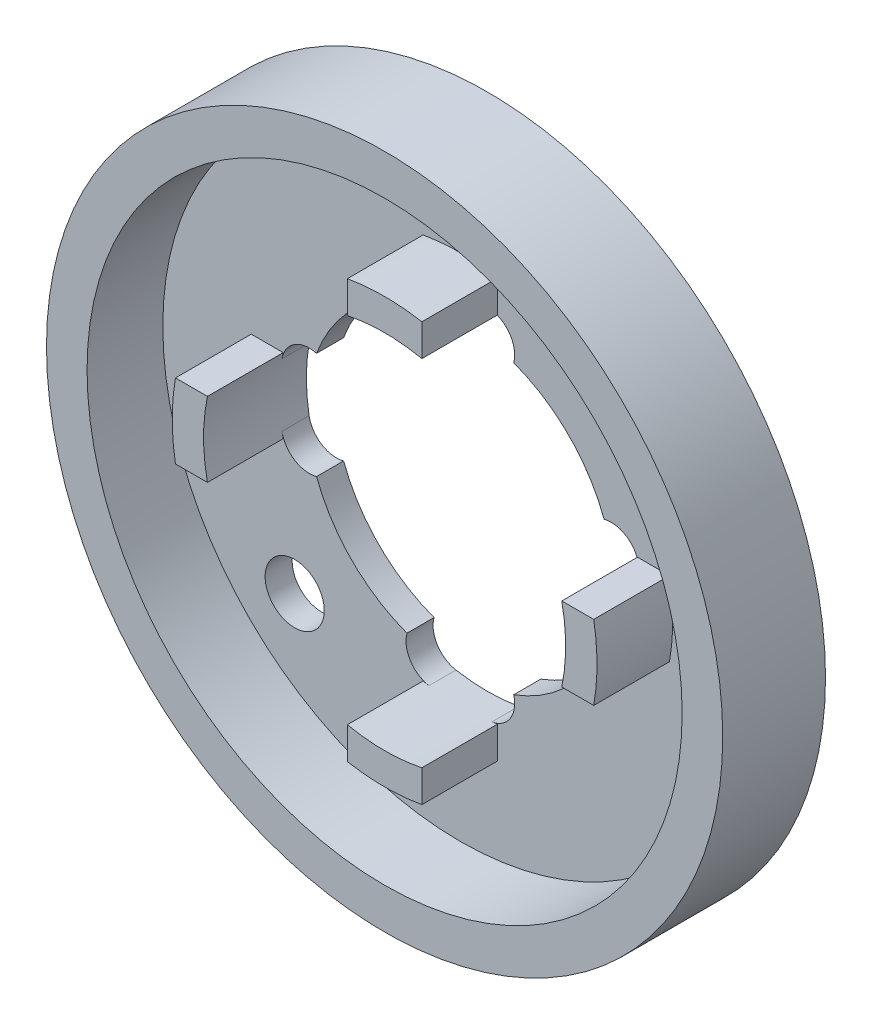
ISO-10303-21;
HEADER;
FILE_DESCRIPTION(('STEP AP214'),'2;1');
FILE_NAME('part.step','',(''),(''),'','','');
FILE_SCHEMA(('AUTOMOTIVE_DESIGN { 1 0 10303 214 1 1 1 1 }'));
ENDSEC;
DATA;
#1=APPLICATION_CONTEXT('core data for automotive mechanical design processes');
#2=APPLICATION_PROTOCOL_DEFINITION('international standard','automotive_design',2000,#1);
#3=PRODUCT_CONTEXT('',#1,'mechanical');
#4=PRODUCT('Part','Part','',(#3));
#5=PRODUCT_RELATED_PRODUCT_CATEGORY('part','',(#4));
#6=PRODUCT_DEFINITION_FORMATION('','',#4);
#7=PRODUCT_DEFINITION_CONTEXT('part definition',#1,'design');
#8=PRODUCT_DEFINITION('design','',#6,#7);
#9=PRODUCT_DEFINITION_SHAPE('','',#8);
#10=(LENGTH_UNIT() NAMED_UNIT(*) SI_UNIT(.MILLI.,.METRE.));
#11=(NAMED_UNIT(*) PLANE_ANGLE_UNIT() SI_UNIT($,.RADIAN.));
#12=(NAMED_UNIT(*) SI_UNIT($,.STERADIAN.) SOLID_ANGLE_UNIT());
#13=UNCERTAINTY_MEASURE_WITH_UNIT(LENGTH_MEASURE(1.E-05),#10,'distance_accuracy_value','');
#14=(GEOMETRIC_REPRESENTATION_CONTEXT(3) GLOBAL_UNCERTAINTY_ASSIGNED_CONTEXT((#13)) GLOBAL_UNIT_ASSIGNED_CONTEXT((#10,
#11,#12)) REPRESENTATION_CONTEXT('',''));
#15=CARTESIAN_POINT('',(0.,0.,0.));
#16=DIRECTION('',(0.,0.,1.));
#17=DIRECTION('',(1.,0.,0.));
#18=AXIS2_PLACEMENT_3D('',#15,#16,#17);
#19=CARTESIAN_POINT('',(0.,0.,0.));
#20=DIRECTION('',(0.,0.,1.));
#21=DIRECTION('',(1.,0.,0.));
#22=AXIS2_PLACEMENT_3D('',#19,#20,#21);
#23=PLANE('',#22);
#24=CARTESIAN_POINT('',(-7.77817459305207,-7.77817459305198,0.));
#25=DIRECTION('',(0.,0.,-1.));
#26=DIRECTION('',(-1.,0.,0.));
#27=AXIS2_PLACEMENT_3D('',#24,#25,#26);
#28=CIRCLE('',#27,1.38912599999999);
#29=CARTESIAN_POINT('',(-9.16730059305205,-7.77817459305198,0.));
#30=VERTEX_POINT('',#29);
#31=EDGE_CURVE('E528',#30,#30,#28,.T.);
#32=ORIENTED_EDGE('',*,*,#31,.F.);
#33=EDGE_LOOP('',(#32));
#34=FACE_BOUND('',#33,.T.);
#35=CARTESIAN_POINT('',(0.,0.,0.));
#36=DIRECTION('',(0.,0.,1.));
#37=DIRECTION('',(1.,0.,0.));
#38=AXIS2_PLACEMENT_3D('',#35,#36,#37);
#39=CIRCLE('',#38,15.875);
#40=CARTESIAN_POINT('',(15.875,0.,0.));
#41=VERTEX_POINT('',#40);
#42=EDGE_CURVE('E44',#41,#41,#39,.T.);
#43=ORIENTED_EDGE('',*,*,#42,.F.);
#44=EDGE_LOOP('',(#43));
#45=FACE_BOUND('',#44,.T.);
#46=CARTESIAN_POINT('',(0.,0.,0.));
#47=DIRECTION('',(0.,0.,1.));
#48=DIRECTION('',(1.,0.,0.));
#49=AXIS2_PLACEMENT_3D('',#46,#47,#48);
#50=CIRCLE('',#49,7.2);
#51=CARTESIAN_POINT('',(2.50490967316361,6.75021685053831,0.));
#52=VERTEX_POINT('',#51);
#53=CARTESIAN_POINT('',(6.75021685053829,2.50490967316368,0.));
#54=VERTEX_POINT('',#53);
#55=EDGE_CURVE('E508',#52,#54,#50,.F.);
#56=ORIENTED_EDGE('',*,*,#55,.F.);
#57=CARTESIAN_POINT('',(1.2502668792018,7.09061582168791,0.));
#58=DIRECTION('',(0.,0.,1.));
#59=DIRECTION('',(1.,0.,0.));
#60=AXIS2_PLACEMENT_3D('',#57,#58,#59);
#61=CIRCLE('',#60,1.3);
#62=CARTESIAN_POINT('',(1.47600951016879,8.37086590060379,0.));
#63=VERTEX_POINT('',#62);
#64=EDGE_CURVE('E534',#63,#52,#61,.F.);
#65=ORIENTED_EDGE('',*,*,#64,.F.);
#66=CARTESIAN_POINT('',(0.,0.,0.));
#67=DIRECTION('',(0.,0.,1.));
#68=DIRECTION('',(1.,0.,0.));
#69=AXIS2_PLACEMENT_3D('',#66,#67,#68);
#70=CIRCLE('',#69,8.5);
#71=CARTESIAN_POINT('',(-1.47600951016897,8.37086590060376,0.));
#72=VERTEX_POINT('',#71);
#73=EDGE_CURVE('E538',#72,#63,#70,.F.);
#74=ORIENTED_EDGE('',*,*,#73,.F.);
#75=CARTESIAN_POINT('',(-1.25026687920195,7.09061582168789,0.));
#76=DIRECTION('',(0.,0.,1.));
#77=DIRECTION('',(1.,0.,0.));
#78=AXIS2_PLACEMENT_3D('',#75,#76,#77);
#79=CIRCLE('',#78,1.3);
#80=CARTESIAN_POINT('',(-2.50490967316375,6.75021685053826,0.));
#81=VERTEX_POINT('',#80);
#82=EDGE_CURVE('E532',#81,#72,#79,.F.);
#83=ORIENTED_EDGE('',*,*,#82,.F.);
#84=CARTESIAN_POINT('',(-6.75021685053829,2.50490967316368,0.));
#85=VERTEX_POINT('',#84);
#86=EDGE_CURVE('E264',#85,#81,#50,.F.);
#87=ORIENTED_EDGE('',*,*,#86,.F.);
#88=CARTESIAN_POINT('',(-7.0906158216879,1.25026687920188,0.));
#89=DIRECTION('',(0.,0.,1.));
#90=DIRECTION('',(1.,0.,0.));
#91=AXIS2_PLACEMENT_3D('',#88,#89,#90);
#92=CIRCLE('',#91,1.3);
#93=CARTESIAN_POINT('',(-8.37086590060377,1.47600951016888,0.));
#94=VERTEX_POINT('',#93);
#95=EDGE_CURVE('E457',#94,#85,#92,.F.);
#96=ORIENTED_EDGE('',*,*,#95,.F.);
#97=CARTESIAN_POINT('',(0.,0.,0.));
#98=DIRECTION('',(0.,0.,1.));
#99=DIRECTION('',(1.,0.,0.));
#100=AXIS2_PLACEMENT_3D('',#97,#98,#99);
#101=CIRCLE('',#100,8.5);
#102=CARTESIAN_POINT('',(-8.37086590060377,-1.47600951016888,0.));
#103=VERTEX_POINT('',#102);
#104=EDGE_CURVE('E465',#103,#94,#101,.F.);
#105=ORIENTED_EDGE('',*,*,#104,.F.);
#106=CARTESIAN_POINT('',(-7.0906158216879,-1.25026687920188,0.));
#107=DIRECTION('',(0.,0.,1.));
#108=DIRECTION('',(1.,0.,0.));
#109=AXIS2_PLACEMENT_3D('',#106,#107,#108);
#110=CIRCLE('',#109,1.3);
#111=CARTESIAN_POINT('',(-6.75021685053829,-2.50490967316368,0.));
#112=VERTEX_POINT('',#111);
#113=EDGE_CURVE('E454',#112,#103,#110,.F.);
#114=ORIENTED_EDGE('',*,*,#113,.F.);
#115=CARTESIAN_POINT('',(-2.50490967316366,-6.75021685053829,0.));
#116=VERTEX_POINT('',#115);
#117=EDGE_CURVE('E284',#116,#112,#50,.F.);
#118=ORIENTED_EDGE('',*,*,#117,.F.);
#119=CARTESIAN_POINT('',(-1.25026687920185,-7.09061582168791,0.));
#120=DIRECTION('',(0.,0.,1.));
#121=DIRECTION('',(1.,0.,0.));
#122=AXIS2_PLACEMENT_3D('',#119,#120,#121);
#123=CIRCLE('',#122,1.3);
#124=CARTESIAN_POINT('',(-1.47600951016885,-8.37086590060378,0.));
#125=VERTEX_POINT('',#124);
#126=EDGE_CURVE('E328',#125,#116,#123,.F.);
#127=ORIENTED_EDGE('',*,*,#126,.F.);
#128=CARTESIAN_POINT('',(0.,0.,0.));
#129=DIRECTION('',(0.,0.,1.));
#130=DIRECTION('',(1.,0.,0.));
#131=AXIS2_PLACEMENT_3D('',#128,#129,#130);
#132=CIRCLE('',#131,8.5);
#133=CARTESIAN_POINT('',(1.47600951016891,-8.37086590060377,0.));
#134=VERTEX_POINT('',#133);
#135=EDGE_CURVE('E336',#134,#125,#132,.F.);
#136=ORIENTED_EDGE('',*,*,#135,.F.);
#137=CARTESIAN_POINT('',(1.2502668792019,-7.0906158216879,0.));
#138=DIRECTION('',(0.,0.,1.));
#139=DIRECTION('',(1.,0.,0.));
#140=AXIS2_PLACEMENT_3D('',#137,#138,#139);
#141=CIRCLE('',#140,1.3);
#142=CARTESIAN_POINT('',(2.50490967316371,-6.75021685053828,0.));
#143=VERTEX_POINT('',#142);
#144=EDGE_CURVE('E325',#143,#134,#141,.F.);
#145=ORIENTED_EDGE('',*,*,#144,.F.);
#146=CARTESIAN_POINT('',(6.75021685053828,-2.50490967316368,0.));
#147=VERTEX_POINT('',#146);
#148=EDGE_CURVE('E289',#147,#143,#50,.F.);
#149=ORIENTED_EDGE('',*,*,#148,.F.);
#150=CARTESIAN_POINT('',(7.0906158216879,-1.25026687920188,0.));
#151=DIRECTION('',(0.,0.,1.));
#152=DIRECTION('',(1.,0.,0.));
#153=AXIS2_PLACEMENT_3D('',#150,#151,#152);
#154=CIRCLE('',#153,1.3);
#155=CARTESIAN_POINT('',(8.37086590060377,-1.47600951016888,0.));
#156=VERTEX_POINT('',#155);
#157=EDGE_CURVE('E308',#156,#147,#154,.F.);
#158=ORIENTED_EDGE('',*,*,#157,.F.);
#159=CARTESIAN_POINT('',(0.,0.,0.));
#160=DIRECTION('',(0.,0.,1.));
#161=DIRECTION('',(1.,0.,0.));
#162=AXIS2_PLACEMENT_3D('',#159,#160,#161);
#163=CIRCLE('',#162,8.5);
#164=CARTESIAN_POINT('',(8.37086590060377,1.47600951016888,0.));
#165=VERTEX_POINT('',#164);
#166=EDGE_CURVE('E318',#165,#156,#163,.F.);
#167=ORIENTED_EDGE('',*,*,#166,.F.);
#168=CARTESIAN_POINT('',(7.0906158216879,1.25026687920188,0.));
#169=DIRECTION('',(0.,0.,1.));
#170=DIRECTION('',(1.,0.,0.));
#171=AXIS2_PLACEMENT_3D('',#168,#169,#170);
#172=CIRCLE('',#171,1.3);
#173=EDGE_CURVE('E312',#54,#165,#172,.F.);
#174=ORIENTED_EDGE('',*,*,#173,.F.);
#175=EDGE_LOOP('',(#56,#65,#74,#83,#87,#96,#105,#114,#118,#127,#136,#145,#149,#158,#167,#174));
#176=FACE_BOUND('',#175,.T.);
#177=CARTESIAN_POINT('',(7.77817459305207,7.77817459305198,0.));
#178=DIRECTION('',(0.,0.,-1.));
#179=DIRECTION('',(-1.,0.,0.));
#180=AXIS2_PLACEMENT_3D('',#177,#178,#179);
#181=CIRCLE('',#180,1.38912599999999);
#182=CARTESIAN_POINT('',(6.38904859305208,7.77817459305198,0.));
#183=VERTEX_POINT('',#182);
#184=EDGE_CURVE('E523',#183,#183,#181,.T.);
#185=ORIENTED_EDGE('',*,*,#184,.F.);
#186=EDGE_LOOP('',(#185));
#187=FACE_BOUND('',#186,.T.);
#188=ADVANCED_FACE('F35',(#34,#45,#176,#187),#23,.F.);
#189=CARTESIAN_POINT('',(0.,0.,-0.00100000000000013));
#190=DIRECTION('',(0.,0.,1.));
#191=DIRECTION('',(1.,0.,0.));
#192=AXIS2_PLACEMENT_3D('',#189,#190,#191);
#193=CYLINDRICAL_SURFACE('',#192,7.2);
#194=CARTESIAN_POINT('',(0.,0.,1.27));
#195=DIRECTION('',(0.,0.,-1.));
#196=DIRECTION('',(-1.,0.,0.));
#197=AXIS2_PLACEMENT_3D('',#194,#195,#196);
#198=CIRCLE('',#197,7.2);
#199=CARTESIAN_POINT('',(6.75021685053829,2.50490967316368,1.27));
#200=VERTEX_POINT('',#199);
#201=CARTESIAN_POINT('',(2.50490967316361,6.75021685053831,1.27));
#202=VERTEX_POINT('',#201);
#203=EDGE_CURVE('E273',#200,#202,#198,.F.);
#204=ORIENTED_EDGE('',*,*,#203,.T.);
#205=DIRECTION('',(0.,0.,1.));
#206=VECTOR('',#205,1.);
#207=CARTESIAN_POINT('',(2.50490967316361,6.75021685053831,0.635));
#208=LINE('',#207,#206);
#209=EDGE_CURVE('E265',#52,#202,#208,.T.);
#210=ORIENTED_EDGE('',*,*,#209,.F.);
#211=ORIENTED_EDGE('',*,*,#55,.T.);
#212=DIRECTION('',(0.,0.,1.));
#213=VECTOR('',#212,1.);
#214=CARTESIAN_POINT('',(6.75021685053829,2.50490967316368,0.635));
#215=LINE('',#214,#213);
#216=EDGE_CURVE('E542',#200,#54,#215,.F.);
#217=ORIENTED_EDGE('',*,*,#216,.F.);
#218=EDGE_LOOP('',(#204,#210,#211,#217));
#219=FACE_BOUND('',#218,.T.);
#220=ADVANCED_FACE('F515',(#219),#193,.F.);
#221=CARTESIAN_POINT('',(2.50490967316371,-6.75021685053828,1.27));
#222=VERTEX_POINT('',#221);
#223=CARTESIAN_POINT('',(6.75021685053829,-2.50490967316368,1.27));
#224=VERTEX_POINT('',#223);
#225=EDGE_CURVE('E278',#222,#224,#198,.F.);
#226=ORIENTED_EDGE('',*,*,#225,.T.);
#227=DIRECTION('',(0.,0.,1.));
#228=VECTOR('',#227,1.);
#229=CARTESIAN_POINT('',(6.75021685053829,-2.50490967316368,0.635));
#230=LINE('',#229,#228);
#231=EDGE_CURVE('E297',#147,#224,#230,.T.);
#232=ORIENTED_EDGE('',*,*,#231,.F.);
#233=ORIENTED_EDGE('',*,*,#148,.T.);
#234=DIRECTION('',(0.,0.,1.));
#235=VECTOR('',#234,1.);
#236=CARTESIAN_POINT('',(2.50490967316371,-6.75021685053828,0.635));
#237=LINE('',#236,#235);
#238=EDGE_CURVE('E300',#222,#143,#237,.F.);
#239=ORIENTED_EDGE('',*,*,#238,.F.);
#240=EDGE_LOOP('',(#226,#232,#233,#239));
#241=FACE_BOUND('',#240,.T.);
#242=ADVANCED_FACE('F296',(#241),#193,.F.);
#243=CARTESIAN_POINT('',(-6.75021685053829,-2.50490967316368,1.27));
#244=VERTEX_POINT('',#243);
#245=CARTESIAN_POINT('',(-2.50490967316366,-6.75021685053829,1.27));
#246=VERTEX_POINT('',#245);
#247=EDGE_CURVE('E276',#244,#246,#198,.F.);
#248=ORIENTED_EDGE('',*,*,#247,.T.);
#249=DIRECTION('',(0.,0.,1.));
#250=VECTOR('',#249,1.);
#251=CARTESIAN_POINT('',(-2.50490967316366,-6.75021685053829,0.635));
#252=LINE('',#251,#250);
#253=EDGE_CURVE('E323',#116,#246,#252,.T.);
#254=ORIENTED_EDGE('',*,*,#253,.F.);
#255=ORIENTED_EDGE('',*,*,#117,.T.);
#256=DIRECTION('',(0.,0.,1.));
#257=VECTOR('',#256,1.);
#258=CARTESIAN_POINT('',(-6.75021685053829,-2.50490967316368,0.635));
#259=LINE('',#258,#257);
#260=EDGE_CURVE('E433',#244,#112,#259,.F.);
#261=ORIENTED_EDGE('',*,*,#260,.F.);
#262=EDGE_LOOP('',(#248,#254,#255,#261));
#263=FACE_BOUND('',#262,.T.);
#264=ADVANCED_FACE('F627',(#263),#193,.F.);
#265=CARTESIAN_POINT('',(-7.,0.,1.27));
#266=DIRECTION('',(0.,0.,-1.));
#267=DIRECTION('',(-1.,0.,0.));
#268=AXIS2_PLACEMENT_3D('',#265,#266,#267);
#269=PLANE('',#268);
#270=CARTESIAN_POINT('',(-7.77817459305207,-7.77817459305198,1.27));
#271=DIRECTION('',(0.,0.,-1.));
#272=DIRECTION('',(-1.,0.,0.));
#273=AXIS2_PLACEMENT_3D('',#270,#271,#272);
#274=CIRCLE('',#273,1.38912599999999);
#275=CARTESIAN_POINT('',(-9.16730059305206,-7.77817459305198,1.27));
#276=VERTEX_POINT('',#275);
#277=EDGE_CURVE('E39',#276,#276,#274,.T.);
#278=ORIENTED_EDGE('',*,*,#277,.T.);
#279=EDGE_LOOP('',(#278));
#280=FACE_BOUND('',#279,.T.);
#281=CARTESIAN_POINT('',(7.77817459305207,7.77817459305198,1.27));
#282=DIRECTION('',(0.,0.,-1.));
#283=DIRECTION('',(-1.,0.,0.));
#284=AXIS2_PLACEMENT_3D('',#281,#282,#283);
#285=CIRCLE('',#284,1.38912599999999);
#286=CARTESIAN_POINT('',(6.38904859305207,7.77817459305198,1.27));
#287=VERTEX_POINT('',#286);
#288=EDGE_CURVE('E266',#287,#287,#285,.T.);
#289=ORIENTED_EDGE('',*,*,#288,.T.);
#290=EDGE_LOOP('',(#289));
#291=FACE_BOUND('',#290,.T.);
#292=CARTESIAN_POINT('',(0.,0.,1.27));
#293=DIRECTION('',(0.,0.,-1.));
#294=DIRECTION('',(-1.,0.,0.));
#295=AXIS2_PLACEMENT_3D('',#292,#293,#294);
#296=CIRCLE('',#295,13.97);
#297=CARTESIAN_POINT('',(-13.97,0.,1.27));
#298=VERTEX_POINT('',#297);
#299=EDGE_CURVE('E274',#298,#298,#296,.T.);
#300=ORIENTED_EDGE('',*,*,#299,.F.);
#301=EDGE_LOOP('',(#300));
#302=FACE_BOUND('',#301,.T.);
#303=CARTESIAN_POINT('',(0.,0.,1.27));
#304=DIRECTION('',(0.,0.,-1.));
#305=DIRECTION('',(0.,-1.,0.));
#306=AXIS2_PLACEMENT_3D('',#303,#304,#305);
#307=CIRCLE('',#306,8.5);
#308=CARTESIAN_POINT('',(1.47600951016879,8.37086590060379,1.27));
#309=VERTEX_POINT('',#308);
#310=CARTESIAN_POINT('',(1.74999999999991,8.31790237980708,1.27));
#311=VERTEX_POINT('',#310);
#312=EDGE_CURVE('E357',#309,#311,#307,.T.);
#313=ORIENTED_EDGE('',*,*,#312,.F.);
#314=CARTESIAN_POINT('',(1.2502668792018,7.09061582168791,1.27));
#315=DIRECTION('',(0.,0.,1.));
#316=DIRECTION('',(0.,-1.,0.));
#317=AXIS2_PLACEMENT_3D('',#314,#315,#316);
#318=CIRCLE('',#317,1.3);
#319=EDGE_CURVE('E52',#202,#309,#318,.T.);
#320=ORIENTED_EDGE('',*,*,#319,.F.);
#321=ORIENTED_EDGE('',*,*,#203,.F.);
#322=CARTESIAN_POINT('',(7.0906158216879,1.25026687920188,1.27));
#323=DIRECTION('',(0.,0.,1.));
#324=DIRECTION('',(-1.,0.,0.));
#325=AXIS2_PLACEMENT_3D('',#322,#323,#324);
#326=CIRCLE('',#325,1.3);
#327=CARTESIAN_POINT('',(8.37086590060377,1.47600951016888,1.27));
#328=VERTEX_POINT('',#327);
#329=EDGE_CURVE('E307',#328,#200,#326,.T.);
#330=ORIENTED_EDGE('',*,*,#329,.F.);
#331=CARTESIAN_POINT('',(0.,0.,1.27));
#332=DIRECTION('',(0.,0.,-1.));
#333=DIRECTION('',(-1.,0.,0.));
#334=AXIS2_PLACEMENT_3D('',#331,#332,#333);
#335=CIRCLE('',#334,8.5);
#336=CARTESIAN_POINT('',(8.31790237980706,1.75,1.27));
#337=VERTEX_POINT('',#336);
#338=EDGE_CURVE('E391',#337,#328,#335,.T.);
#339=ORIENTED_EDGE('',*,*,#338,.F.);
#340=DIRECTION('',(-1.,0.,0.));
#341=VECTOR('',#340,1.);
#342=CARTESIAN_POINT('',(8.31790237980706,1.75,1.27));
#343=LINE('',#342,#341);
#344=CARTESIAN_POINT('',(9.81790237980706,1.75,1.27));
#345=VERTEX_POINT('',#344);
#346=EDGE_CURVE('E378',#345,#337,#343,.T.);
#347=ORIENTED_EDGE('',*,*,#346,.F.);
#348=CARTESIAN_POINT('',(0.,0.,1.27));
#349=DIRECTION('',(0.,0.,1.));
#350=DIRECTION('',(-1.,0.,0.));
#351=AXIS2_PLACEMENT_3D('',#348,#349,#350);
#352=CIRCLE('',#351,9.97264795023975);
#353=CARTESIAN_POINT('',(9.81790237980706,-1.75,1.27));
#354=VERTEX_POINT('',#353);
#355=EDGE_CURVE('E383',#354,#345,#352,.T.);
#356=ORIENTED_EDGE('',*,*,#355,.F.);
#357=DIRECTION('',(1.,0.,0.));
#358=VECTOR('',#357,1.);
#359=CARTESIAN_POINT('',(8.31790237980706,-1.75,1.27));
#360=LINE('',#359,#358);
#361=CARTESIAN_POINT('',(8.31790237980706,-1.75,1.27));
#362=VERTEX_POINT('',#361);
#363=EDGE_CURVE('E387',#362,#354,#360,.T.);
#364=ORIENTED_EDGE('',*,*,#363,.F.);
#365=CARTESIAN_POINT('',(8.37086590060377,-1.47600951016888,1.27));
#366=VERTEX_POINT('',#365);
#367=EDGE_CURVE('E306',#366,#362,#335,.T.);
#368=ORIENTED_EDGE('',*,*,#367,.F.);
#369=CARTESIAN_POINT('',(7.0906158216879,-1.25026687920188,1.27));
#370=DIRECTION('',(0.,0.,1.));
#371=DIRECTION('',(-1.,0.,0.));
#372=AXIS2_PLACEMENT_3D('',#369,#370,#371);
#373=CIRCLE('',#372,1.3);
#374=EDGE_CURVE('E60',#224,#366,#373,.T.);
#375=ORIENTED_EDGE('',*,*,#374,.F.);
#376=ORIENTED_EDGE('',*,*,#225,.F.);
#377=CARTESIAN_POINT('',(1.2502668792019,-7.0906158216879,1.27));
#378=DIRECTION('',(0.,0.,1.));
#379=DIRECTION('',(0.,1.,0.));
#380=AXIS2_PLACEMENT_3D('',#377,#378,#379);
#381=CIRCLE('',#380,1.3);
#382=CARTESIAN_POINT('',(1.47600951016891,-8.37086590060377,1.27));
#383=VERTEX_POINT('',#382);
#384=EDGE_CURVE('E302',#383,#222,#381,.T.);
#385=ORIENTED_EDGE('',*,*,#384,.F.);
#386=CARTESIAN_POINT('',(0.,0.,1.27));
#387=DIRECTION('',(0.,0.,-1.));
#388=DIRECTION('',(0.,1.,0.));
#389=AXIS2_PLACEMENT_3D('',#386,#387,#388);
#390=CIRCLE('',#389,8.5);
#391=CARTESIAN_POINT('',(1.75000000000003,-8.31790237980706,1.27));
#392=VERTEX_POINT('',#391);
#393=EDGE_CURVE('E427',#392,#383,#390,.T.);
#394=ORIENTED_EDGE('',*,*,#393,.F.);
#395=DIRECTION('',(0.,1.,0.));
#396=VECTOR('',#395,1.);
#397=CARTESIAN_POINT('',(1.75000000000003,-8.31790237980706,1.27));
#398=LINE('',#397,#396);
#399=CARTESIAN_POINT('',(1.75000000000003,-9.81790237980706,1.27));
#400=VERTEX_POINT('',#399);
#401=EDGE_CURVE('E414',#400,#392,#398,.T.);
#402=ORIENTED_EDGE('',*,*,#401,.F.);
#403=CARTESIAN_POINT('',(0.,0.,1.27));
#404=DIRECTION('',(0.,0.,1.));
#405=DIRECTION('',(0.,1.,0.));
#406=AXIS2_PLACEMENT_3D('',#403,#404,#405);
#407=CIRCLE('',#406,9.97264795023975);
#408=CARTESIAN_POINT('',(-1.74999999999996,-9.81790237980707,1.27));
#409=VERTEX_POINT('',#408);
#410=EDGE_CURVE('E419',#409,#400,#407,.T.);
#411=ORIENTED_EDGE('',*,*,#410,.F.);
#412=DIRECTION('',(0.,-1.,0.));
#413=VECTOR('',#412,1.);
#414=CARTESIAN_POINT('',(-1.74999999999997,-8.31790237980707,1.27));
#415=LINE('',#414,#413);
#416=CARTESIAN_POINT('',(-1.74999999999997,-8.31790237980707,1.27));
#417=VERTEX_POINT('',#416);
#418=EDGE_CURVE('E423',#417,#409,#415,.T.);
#419=ORIENTED_EDGE('',*,*,#418,.F.);
#420=CARTESIAN_POINT('',(-1.47600951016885,-8.37086590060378,1.27));
#421=VERTEX_POINT('',#420);
#422=EDGE_CURVE('E429',#421,#417,#390,.T.);
#423=ORIENTED_EDGE('',*,*,#422,.F.);
#424=CARTESIAN_POINT('',(-1.25026687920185,-7.09061582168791,1.27));
#425=DIRECTION('',(0.,0.,1.));
#426=DIRECTION('',(0.,1.,0.));
#427=AXIS2_PLACEMENT_3D('',#424,#425,#426);
#428=CIRCLE('',#427,1.3);
#429=EDGE_CURVE('E330',#246,#421,#428,.T.);
#430=ORIENTED_EDGE('',*,*,#429,.F.);
#431=ORIENTED_EDGE('',*,*,#247,.F.);
#432=CARTESIAN_POINT('',(-7.0906158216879,-1.25026687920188,1.27));
#433=DIRECTION('',(0.,0.,1.));
#434=DIRECTION('',(1.,0.,0.));
#435=AXIS2_PLACEMENT_3D('',#432,#433,#434);
#436=CIRCLE('',#435,1.3);
#437=CARTESIAN_POINT('',(-8.37086590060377,-1.47600951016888,1.27));
#438=VERTEX_POINT('',#437);
#439=EDGE_CURVE('E460',#438,#244,#436,.T.);
#440=ORIENTED_EDGE('',*,*,#439,.F.);
#441=CARTESIAN_POINT('',(0.,0.,1.27));
#442=DIRECTION('',(0.,0.,-1.));
#443=DIRECTION('',(1.,0.,0.));
#444=AXIS2_PLACEMENT_3D('',#441,#442,#443);
#445=CIRCLE('',#444,8.5);
#446=CARTESIAN_POINT('',(-8.31790237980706,-1.75,1.27));
#447=VERTEX_POINT('',#446);
#448=EDGE_CURVE('E484',#447,#438,#445,.T.);
#449=ORIENTED_EDGE('',*,*,#448,.F.);
#450=DIRECTION('',(1.,0.,0.));
#451=VECTOR('',#450,1.);
#452=CARTESIAN_POINT('',(-8.31790237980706,-1.75,1.27));
#453=LINE('',#452,#451);
#454=CARTESIAN_POINT('',(-9.81790237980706,-1.75,1.27));
#455=VERTEX_POINT('',#454);
#456=EDGE_CURVE('E471',#455,#447,#453,.T.);
#457=ORIENTED_EDGE('',*,*,#456,.F.);
#458=CARTESIAN_POINT('',(0.,0.,1.27));
#459=DIRECTION('',(0.,0.,1.));
#460=DIRECTION('',(1.,0.,0.));
#461=AXIS2_PLACEMENT_3D('',#458,#459,#460);
#462=CIRCLE('',#461,9.97264795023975);
#463=CARTESIAN_POINT('',(-9.81790237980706,1.75,1.27));
#464=VERTEX_POINT('',#463);
#465=EDGE_CURVE('E476',#464,#455,#462,.T.);
#466=ORIENTED_EDGE('',*,*,#465,.F.);
#467=DIRECTION('',(-1.,0.,0.));
#468=VECTOR('',#467,1.);
#469=CARTESIAN_POINT('',(-8.31790237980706,1.75,1.27));
#470=LINE('',#469,#468);
#471=CARTESIAN_POINT('',(-8.31790237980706,1.75,1.27));
#472=VERTEX_POINT('',#471);
#473=EDGE_CURVE('E480',#472,#464,#470,.T.);
#474=ORIENTED_EDGE('',*,*,#473,.F.);
#475=CARTESIAN_POINT('',(-8.37086590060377,1.47600951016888,1.27));
#476=VERTEX_POINT('',#475);
#477=EDGE_CURVE('E487',#476,#472,#445,.T.);
#478=ORIENTED_EDGE('',*,*,#477,.F.);
#479=CARTESIAN_POINT('',(-7.0906158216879,1.25026687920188,1.27));
#480=DIRECTION('',(0.,0.,1.));
#481=DIRECTION('',(1.,0.,0.));
#482=AXIS2_PLACEMENT_3D('',#479,#480,#481);
#483=CIRCLE('',#482,1.3);
#484=CARTESIAN_POINT('',(-6.75021685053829,2.50490967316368,1.27));
#485=VERTEX_POINT('',#484);
#486=EDGE_CURVE('E272',#485,#476,#483,.T.);
#487=ORIENTED_EDGE('',*,*,#486,.F.);
#488=CARTESIAN_POINT('',(-2.50490967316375,6.75021685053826,1.27));
#489=VERTEX_POINT('',#488);
#490=EDGE_CURVE('E261',#489,#485,#198,.F.);
#491=ORIENTED_EDGE('',*,*,#490,.F.);
#492=CARTESIAN_POINT('',(-1.25026687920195,7.09061582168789,1.27));
#493=DIRECTION('',(0.,0.,1.));
#494=DIRECTION('',(0.,-1.,0.));
#495=AXIS2_PLACEMENT_3D('',#492,#493,#494);
#496=CIRCLE('',#495,1.3);
#497=CARTESIAN_POINT('',(-1.47600951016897,8.37086590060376,1.27));
#498=VERTEX_POINT('',#497);
#499=EDGE_CURVE('E245',#498,#489,#496,.T.);
#500=ORIENTED_EDGE('',*,*,#499,.F.);
#501=CARTESIAN_POINT('',(-1.75000000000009,8.31790237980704,1.27));
#502=VERTEX_POINT('',#501);
#503=EDGE_CURVE('E355',#502,#498,#307,.T.);
#504=ORIENTED_EDGE('',*,*,#503,.F.);
#505=DIRECTION('',(0.,-1.,0.));
#506=VECTOR('',#505,1.);
#507=CARTESIAN_POINT('',(-1.75000000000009,8.31790237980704,1.27));
#508=LINE('',#507,#506);
#509=CARTESIAN_POINT('',(-1.7500000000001,9.81790237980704,1.27));
#510=VERTEX_POINT('',#509);
#511=EDGE_CURVE('E342',#510,#502,#508,.T.);
#512=ORIENTED_EDGE('',*,*,#511,.F.);
#513=CARTESIAN_POINT('',(0.,0.,1.27));
#514=DIRECTION('',(0.,0.,1.));
#515=DIRECTION('',(0.,-1.,0.));
#516=AXIS2_PLACEMENT_3D('',#513,#514,#515);
#517=CIRCLE('',#516,9.97264795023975);
#518=CARTESIAN_POINT('',(1.7499999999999,9.81790237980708,1.27));
#519=VERTEX_POINT('',#518);
#520=EDGE_CURVE('E347',#519,#510,#517,.T.);
#521=ORIENTED_EDGE('',*,*,#520,.F.);
#522=DIRECTION('',(0.,1.,0.));
#523=VECTOR('',#522,1.);
#524=CARTESIAN_POINT('',(1.74999999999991,8.31790237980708,1.27));
#525=LINE('',#524,#523);
#526=EDGE_CURVE('E351',#311,#519,#525,.T.);
#527=ORIENTED_EDGE('',*,*,#526,.F.);
#528=EDGE_LOOP('',(#313,#320,#321,#330,#339,#347,#356,#364,#368,#375,#376,#385,#394,#402,#411,
#419,#423,#430,#431,#440,#449,#457,#466,#474,#478,#487,#491,#500,#504,#512,#521,#527));
#529=FACE_BOUND('',#528,.T.);
#530=ADVANCED_FACE('F270',(#280,#291,#302,#529),#269,.F.);
#531=CARTESIAN_POINT('',(0.,0.,4.826));
#532=DIRECTION('',(0.,0.,-1.));
#533=DIRECTION('',(-1.,0.,0.));
#534=AXIS2_PLACEMENT_3D('',#531,#532,#533);
#535=CYLINDRICAL_SURFACE('',#534,15.875);
#536=CARTESIAN_POINT('',(0.,0.,4.826));
#537=DIRECTION('',(0.,0.,1.));
#538=DIRECTION('',(1.,0.,0.));
#539=AXIS2_PLACEMENT_3D('',#536,#537,#538);
#540=CIRCLE('',#539,15.875);
#541=CARTESIAN_POINT('',(15.875,0.,4.826));
#542=VERTEX_POINT('',#541);
#543=EDGE_CURVE('E11',#542,#542,#540,.T.);
#544=ORIENTED_EDGE('',*,*,#543,.F.);
#545=EDGE_LOOP('',(#544));
#546=FACE_BOUND('',#545,.T.);
#547=ORIENTED_EDGE('',*,*,#42,.T.);
#548=EDGE_LOOP('',(#547));
#549=FACE_BOUND('',#548,.T.);
#550=ADVANCED_FACE('F37',(#546,#549),#535,.T.);
#551=CARTESIAN_POINT('',(0.,0.,4.826));
#552=DIRECTION('',(0.,0.,1.));
#553=DIRECTION('',(1.,0.,0.));
#554=AXIS2_PLACEMENT_3D('',#551,#552,#553);
#555=PLANE('',#554);
#556=CARTESIAN_POINT('',(0.,0.,4.826));
#557=DIRECTION('',(0.,0.,-1.));
#558=DIRECTION('',(-1.,0.,0.));
#559=AXIS2_PLACEMENT_3D('',#556,#557,#558);
#560=CIRCLE('',#559,13.97);
#561=CARTESIAN_POINT('',(-13.97,0.,4.826));
#562=VERTEX_POINT('',#561);
#563=EDGE_CURVE('E280',#562,#562,#560,.T.);
#564=ORIENTED_EDGE('',*,*,#563,.T.);
#565=EDGE_LOOP('',(#564));
#566=FACE_BOUND('',#565,.T.);
#567=ORIENTED_EDGE('',*,*,#543,.T.);
#568=EDGE_LOOP('',(#567));
#569=FACE_BOUND('',#568,.T.);
#570=ADVANCED_FACE('F631',(#566,#569),#555,.T.);
#571=ORIENTED_EDGE('',*,*,#86,.T.);
#572=DIRECTION('',(0.,0.,1.));
#573=VECTOR('',#572,1.);
#574=CARTESIAN_POINT('',(-2.50490967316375,6.75021685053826,0.635));
#575=LINE('',#574,#573);
#576=EDGE_CURVE('E249',#489,#81,#575,.F.);
#577=ORIENTED_EDGE('',*,*,#576,.F.);
#578=ORIENTED_EDGE('',*,*,#490,.T.);
#579=DIRECTION('',(0.,0.,1.));
#580=VECTOR('',#579,1.);
#581=CARTESIAN_POINT('',(-6.75021685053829,2.50490967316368,0.635));
#582=LINE('',#581,#580);
#583=EDGE_CURVE('E452',#85,#485,#582,.T.);
#584=ORIENTED_EDGE('',*,*,#583,.F.);
#585=EDGE_LOOP('',(#571,#577,#578,#584));
#586=FACE_BOUND('',#585,.T.);
#587=ADVANCED_FACE('F259',(#586),#193,.F.);
#588=CARTESIAN_POINT('',(0.,0.,0.));
#589=DIRECTION('',(0.,0.,-1.));
#590=DIRECTION('',(-1.,0.,0.));
#591=AXIS2_PLACEMENT_3D('',#588,#589,#590);
#592=CYLINDRICAL_SURFACE('',#591,13.97);
#593=ORIENTED_EDGE('',*,*,#563,.F.);
#594=EDGE_LOOP('',(#593));
#595=FACE_BOUND('',#594,.T.);
#596=ORIENTED_EDGE('',*,*,#299,.T.);
#597=EDGE_LOOP('',(#596));
#598=FACE_BOUND('',#597,.T.);
#599=ADVANCED_FACE('F617',(#595,#598),#592,.F.);
#600=CARTESIAN_POINT('',(0.,0.,8.69745746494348));
#601=DIRECTION('',(0.,0.,-1.));
#602=DIRECTION('',(-1.,0.,0.));
#603=AXIS2_PLACEMENT_3D('',#600,#601,#602);
#604=CYLINDRICAL_SURFACE('',#603,8.5);
#605=CARTESIAN_POINT('',(0.,0.,4.826));
#606=DIRECTION('',(0.,0.,1.));
#607=DIRECTION('',(1.,0.,0.));
#608=AXIS2_PLACEMENT_3D('',#605,#606,#607);
#609=CIRCLE('',#608,8.5);
#610=CARTESIAN_POINT('',(-8.31790237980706,-1.75,4.826));
#611=VERTEX_POINT('',#610);
#612=CARTESIAN_POINT('',(-8.31790237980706,1.75,4.826));
#613=VERTEX_POINT('',#612);
#614=EDGE_CURVE('E494',#611,#613,#609,.F.);
#615=ORIENTED_EDGE('',*,*,#614,.F.);
#616=DIRECTION('',(0.,0.,-1.));
#617=VECTOR('',#616,1.);
#618=CARTESIAN_POINT('',(-8.31790237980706,-1.75,8.69745746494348));
#619=LINE('',#618,#617);
#620=EDGE_CURVE('E470',#611,#447,#619,.T.);
#621=ORIENTED_EDGE('',*,*,#620,.T.);
#622=ORIENTED_EDGE('',*,*,#448,.T.);
#623=DIRECTION('',(0.,0.,1.));
#624=VECTOR('',#623,1.);
#625=CARTESIAN_POINT('',(-8.37086590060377,-1.47600951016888,-0.000999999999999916));
#626=LINE('',#625,#624);
#627=EDGE_CURVE('E463',#103,#438,#626,.T.);
#628=ORIENTED_EDGE('',*,*,#627,.F.);
#629=ORIENTED_EDGE('',*,*,#104,.T.);
#630=DIRECTION('',(0.,0.,1.));
#631=VECTOR('',#630,1.);
#632=CARTESIAN_POINT('',(-8.37086590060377,1.47600951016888,-0.000999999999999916));
#633=LINE('',#632,#631);
#634=EDGE_CURVE('E462',#94,#476,#633,.T.);
#635=ORIENTED_EDGE('',*,*,#634,.T.);
#636=ORIENTED_EDGE('',*,*,#477,.T.);
#637=DIRECTION('',(0.,0.,-1.));
#638=VECTOR('',#637,1.);
#639=CARTESIAN_POINT('',(-8.31790237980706,1.75,8.69745746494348));
#640=LINE('',#639,#638);
#641=EDGE_CURVE('E483',#613,#472,#640,.T.);
#642=ORIENTED_EDGE('',*,*,#641,.F.);
#643=EDGE_LOOP('',(#615,#621,#622,#628,#629,#635,#636,#642));
#644=FACE_BOUND('',#643,.T.);
#645=ADVANCED_FACE('F613',(#644),#604,.F.);
#646=CARTESIAN_POINT('',(-8.31790237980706,1.75,8.69745746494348));
#647=DIRECTION('',(0.,-1.,0.));
#648=DIRECTION('',(1.,0.,0.));
#649=AXIS2_PLACEMENT_3D('',#646,#647,#648);
#650=PLANE('',#649);
#651=DIRECTION('',(-1.,0.,0.));
#652=VECTOR('',#651,1.);
#653=CARTESIAN_POINT('',(-8.31790237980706,1.75,4.826));
#654=LINE('',#653,#652);
#655=CARTESIAN_POINT('',(-9.81790237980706,1.75,4.826));
#656=VERTEX_POINT('',#655);
#657=EDGE_CURVE('E491',#613,#656,#654,.T.);
#658=ORIENTED_EDGE('',*,*,#657,.F.);
#659=ORIENTED_EDGE('',*,*,#641,.T.);
#660=ORIENTED_EDGE('',*,*,#473,.T.);
#661=DIRECTION('',(0.,0.,-1.));
#662=VECTOR('',#661,1.);
#663=CARTESIAN_POINT('',(-9.81790237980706,1.75,8.69745746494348));
#664=LINE('',#663,#662);
#665=EDGE_CURVE('E479',#656,#464,#664,.T.);
#666=ORIENTED_EDGE('',*,*,#665,.F.);
#667=EDGE_LOOP('',(#658,#659,#660,#666));
#668=FACE_BOUND('',#667,.T.);
#669=ADVANCED_FACE('F609',(#668),#650,.F.);
#670=CARTESIAN_POINT('',(0.,0.,8.69745746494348));
#671=DIRECTION('',(0.,0.,-1.));
#672=DIRECTION('',(-1.,0.,0.));
#673=AXIS2_PLACEMENT_3D('',#670,#671,#672);
#674=CYLINDRICAL_SURFACE('',#673,9.97264795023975);
#675=CARTESIAN_POINT('',(0.,0.,4.826));
#676=DIRECTION('',(0.,0.,1.));
#677=DIRECTION('',(1.,0.,0.));
#678=AXIS2_PLACEMENT_3D('',#675,#676,#677);
#679=CIRCLE('',#678,9.97264795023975);
#680=CARTESIAN_POINT('',(-9.81790237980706,-1.75,4.826));
#681=VERTEX_POINT('',#680);
#682=EDGE_CURVE('E488',#656,#681,#679,.T.);
#683=ORIENTED_EDGE('',*,*,#682,.F.);
#684=ORIENTED_EDGE('',*,*,#665,.T.);
#685=ORIENTED_EDGE('',*,*,#465,.T.);
#686=DIRECTION('',(0.,0.,-1.));
#687=VECTOR('',#686,1.);
#688=CARTESIAN_POINT('',(-9.81790237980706,-1.75,8.69745746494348));
#689=LINE('',#688,#687);
#690=EDGE_CURVE('E475',#681,#455,#689,.T.);
#691=ORIENTED_EDGE('',*,*,#690,.F.);
#692=EDGE_LOOP('',(#683,#684,#685,#691));
#693=FACE_BOUND('',#692,.T.);
#694=ADVANCED_FACE('F605',(#693),#674,.T.);
#695=CARTESIAN_POINT('',(-8.31790237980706,-1.75,8.69745746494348));
#696=DIRECTION('',(0.,1.,0.));
#697=DIRECTION('',(0.,0.,1.));
#698=AXIS2_PLACEMENT_3D('',#695,#696,#697);
#699=PLANE('',#698);
#700=DIRECTION('',(1.,0.,0.));
#701=VECTOR('',#700,1.);
#702=CARTESIAN_POINT('',(-8.31790237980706,-1.75,4.826));
#703=LINE('',#702,#701);
#704=EDGE_CURVE('E474',#681,#611,#703,.T.);
#705=ORIENTED_EDGE('',*,*,#704,.F.);
#706=ORIENTED_EDGE('',*,*,#690,.T.);
#707=ORIENTED_EDGE('',*,*,#456,.T.);
#708=ORIENTED_EDGE('',*,*,#620,.F.);
#709=EDGE_LOOP('',(#705,#706,#707,#708));
#710=FACE_BOUND('',#709,.T.);
#711=ADVANCED_FACE('F602',(#710),#699,.F.);
#712=CARTESIAN_POINT('',(0.,0.,4.826));
#713=DIRECTION('',(0.,0.,1.));
#714=DIRECTION('',(1.,0.,0.));
#715=AXIS2_PLACEMENT_3D('',#712,#713,#714);
#716=PLANE('',#715);
#717=ORIENTED_EDGE('',*,*,#704,.T.);
#718=ORIENTED_EDGE('',*,*,#614,.T.);
#719=ORIENTED_EDGE('',*,*,#657,.T.);
#720=ORIENTED_EDGE('',*,*,#682,.T.);
#721=EDGE_LOOP('',(#717,#718,#719,#720));
#722=FACE_BOUND('',#721,.T.);
#723=ADVANCED_FACE('F600',(#722),#716,.T.);
#724=CARTESIAN_POINT('',(-7.0906158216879,1.25026687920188,-0.000999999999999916));
#725=DIRECTION('',(0.,0.,1.));
#726=DIRECTION('',(1.,0.,0.));
#727=AXIS2_PLACEMENT_3D('',#724,#725,#726);
#728=CYLINDRICAL_SURFACE('',#727,1.3);
#729=ORIENTED_EDGE('',*,*,#95,.T.);
#730=ORIENTED_EDGE('',*,*,#583,.T.);
#731=ORIENTED_EDGE('',*,*,#486,.T.);
#732=ORIENTED_EDGE('',*,*,#634,.F.);
#733=EDGE_LOOP('',(#729,#730,#731,#732));
#734=FACE_BOUND('',#733,.T.);
#735=ADVANCED_FACE('F596',(#734),#728,.F.);
#736=CARTESIAN_POINT('',(-7.0906158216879,-1.25026687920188,-0.000999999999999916));
#737=DIRECTION('',(0.,0.,1.));
#738=DIRECTION('',(1.,0.,0.));
#739=AXIS2_PLACEMENT_3D('',#736,#737,#738);
#740=CYLINDRICAL_SURFACE('',#739,1.3);
#741=ORIENTED_EDGE('',*,*,#113,.T.);
#742=ORIENTED_EDGE('',*,*,#627,.T.);
#743=ORIENTED_EDGE('',*,*,#439,.T.);
#744=ORIENTED_EDGE('',*,*,#260,.T.);
#745=EDGE_LOOP('',(#741,#742,#743,#744));
#746=FACE_BOUND('',#745,.T.);
#747=ADVANCED_FACE('F593',(#746),#740,.F.);
#748=CARTESIAN_POINT('',(0.,0.,8.69745746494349));
#749=DIRECTION('',(0.,0.,-1.));
#750=DIRECTION('',(-1.,0.,0.));
#751=AXIS2_PLACEMENT_3D('',#748,#749,#750);
#752=CYLINDRICAL_SURFACE('',#751,8.5);
#753=CARTESIAN_POINT('',(0.,0.,4.826));
#754=DIRECTION('',(0.,0.,1.));
#755=DIRECTION('',(1.,0.,0.));
#756=AXIS2_PLACEMENT_3D('',#753,#754,#755);
#757=CIRCLE('',#756,8.5);
#758=CARTESIAN_POINT('',(1.75000000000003,-8.31790237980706,4.826));
#759=VERTEX_POINT('',#758);
#760=CARTESIAN_POINT('',(-1.74999999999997,-8.31790237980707,4.826));
#761=VERTEX_POINT('',#760);
#762=EDGE_CURVE('E437',#759,#761,#757,.F.);
#763=ORIENTED_EDGE('',*,*,#762,.F.);
#764=DIRECTION('',(0.,0.,-1.));
#765=VECTOR('',#764,1.);
#766=CARTESIAN_POINT('',(1.75000000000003,-8.31790237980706,8.69745746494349));
#767=LINE('',#766,#765);
#768=EDGE_CURVE('E397',#759,#392,#767,.T.);
#769=ORIENTED_EDGE('',*,*,#768,.T.);
#770=ORIENTED_EDGE('',*,*,#393,.T.);
#771=DIRECTION('',(0.,0.,1.));
#772=VECTOR('',#771,1.);
#773=CARTESIAN_POINT('',(1.47600951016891,-8.37086590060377,-0.000999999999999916));
#774=LINE('',#773,#772);
#775=EDGE_CURVE('E334',#134,#383,#774,.T.);
#776=ORIENTED_EDGE('',*,*,#775,.F.);
#777=ORIENTED_EDGE('',*,*,#135,.T.);
#778=DIRECTION('',(0.,0.,1.));
#779=VECTOR('',#778,1.);
#780=CARTESIAN_POINT('',(-1.47600951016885,-8.37086590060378,-0.000999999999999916));
#781=LINE('',#780,#779);
#782=EDGE_CURVE('E333',#125,#421,#781,.T.);
#783=ORIENTED_EDGE('',*,*,#782,.T.);
#784=ORIENTED_EDGE('',*,*,#422,.T.);
#785=DIRECTION('',(0.,0.,-1.));
#786=VECTOR('',#785,1.);
#787=CARTESIAN_POINT('',(-1.74999999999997,-8.31790237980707,8.69745746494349));
#788=LINE('',#787,#786);
#789=EDGE_CURVE('E426',#761,#417,#788,.T.);
#790=ORIENTED_EDGE('',*,*,#789,.F.);
#791=EDGE_LOOP('',(#763,#769,#770,#776,#777,#783,#784,#790));
#792=FACE_BOUND('',#791,.T.);
#793=ADVANCED_FACE('F566',(#792),#752,.F.);
#794=CARTESIAN_POINT('',(-1.74999999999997,-8.31790237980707,8.69745746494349));
#795=DIRECTION('',(1.,0.,0.));
#796=DIRECTION('',(0.,1.,0.));
#797=AXIS2_PLACEMENT_3D('',#794,#795,#796);
#798=PLANE('',#797);
#799=DIRECTION('',(0.,-1.,0.));
#800=VECTOR('',#799,1.);
#801=CARTESIAN_POINT('',(-1.74999999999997,-8.31790237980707,4.826));
#802=LINE('',#801,#800);
#803=CARTESIAN_POINT('',(-1.74999999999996,-9.81790237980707,4.826));
#804=VERTEX_POINT('',#803);
#805=EDGE_CURVE('E434',#761,#804,#802,.T.);
#806=ORIENTED_EDGE('',*,*,#805,.F.);
#807=ORIENTED_EDGE('',*,*,#789,.T.);
#808=ORIENTED_EDGE('',*,*,#418,.T.);
#809=DIRECTION('',(0.,0.,-1.));
#810=VECTOR('',#809,1.);
#811=CARTESIAN_POINT('',(-1.74999999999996,-9.81790237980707,8.69745746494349));
#812=LINE('',#811,#810);
#813=EDGE_CURVE('E422',#804,#409,#812,.T.);
#814=ORIENTED_EDGE('',*,*,#813,.F.);
#815=EDGE_LOOP('',(#806,#807,#808,#814));
#816=FACE_BOUND('',#815,.T.);
#817=ADVANCED_FACE('F576',(#816),#798,.F.);
#818=CARTESIAN_POINT('',(0.,0.,8.69745746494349));
#819=DIRECTION('',(0.,0.,-1.));
#820=DIRECTION('',(-1.,0.,0.));
#821=AXIS2_PLACEMENT_3D('',#818,#819,#820);
#822=CYLINDRICAL_SURFACE('',#821,9.97264795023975);
#823=CARTESIAN_POINT('',(0.,0.,4.826));
#824=DIRECTION('',(0.,0.,1.));
#825=DIRECTION('',(1.,0.,0.));
#826=AXIS2_PLACEMENT_3D('',#823,#824,#825);
#827=CIRCLE('',#826,9.97264795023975);
#828=CARTESIAN_POINT('',(1.75000000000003,-9.81790237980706,4.826));
#829=VERTEX_POINT('',#828);
#830=EDGE_CURVE('E430',#804,#829,#827,.T.);
#831=ORIENTED_EDGE('',*,*,#830,.F.);
#832=ORIENTED_EDGE('',*,*,#813,.T.);
#833=ORIENTED_EDGE('',*,*,#410,.T.);
#834=DIRECTION('',(0.,0.,-1.));
#835=VECTOR('',#834,1.);
#836=CARTESIAN_POINT('',(1.75000000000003,-9.81790237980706,8.69745746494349));
#837=LINE('',#836,#835);
#838=EDGE_CURVE('E418',#829,#400,#837,.T.);
#839=ORIENTED_EDGE('',*,*,#838,.F.);
#840=EDGE_LOOP('',(#831,#832,#833,#839));
#841=FACE_BOUND('',#840,.T.);
#842=ADVANCED_FACE('F573',(#841),#822,.T.);
#843=CARTESIAN_POINT('',(1.75000000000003,-8.31790237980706,8.69745746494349));
#844=DIRECTION('',(-1.,0.,0.));
#845=DIRECTION('',(0.,-1.,0.));
#846=AXIS2_PLACEMENT_3D('',#843,#844,#845);
#847=PLANE('',#846);
#848=DIRECTION('',(0.,1.,0.));
#849=VECTOR('',#848,1.);
#850=CARTESIAN_POINT('',(1.75000000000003,-8.31790237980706,4.826));
#851=LINE('',#850,#849);
#852=EDGE_CURVE('E417',#829,#759,#851,.T.);
#853=ORIENTED_EDGE('',*,*,#852,.F.);
#854=ORIENTED_EDGE('',*,*,#838,.T.);
#855=ORIENTED_EDGE('',*,*,#401,.T.);
#856=ORIENTED_EDGE('',*,*,#768,.F.);
#857=EDGE_LOOP('',(#853,#854,#855,#856));
#858=FACE_BOUND('',#857,.T.);
#859=ADVANCED_FACE('F571',(#858),#847,.F.);
#860=CARTESIAN_POINT('',(0.,0.,4.826));
#861=DIRECTION('',(0.,0.,1.));
#862=DIRECTION('',(1.,0.,0.));
#863=AXIS2_PLACEMENT_3D('',#860,#861,#862);
#864=PLANE('',#863);
#865=ORIENTED_EDGE('',*,*,#852,.T.);
#866=ORIENTED_EDGE('',*,*,#762,.T.);
#867=ORIENTED_EDGE('',*,*,#805,.T.);
#868=ORIENTED_EDGE('',*,*,#830,.T.);
#869=EDGE_LOOP('',(#865,#866,#867,#868));
#870=FACE_BOUND('',#869,.T.);
#871=ADVANCED_FACE('F580',(#870),#864,.T.);
#872=CARTESIAN_POINT('',(0.,0.,8.69745746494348));
#873=DIRECTION('',(0.,0.,-1.));
#874=DIRECTION('',(-1.,0.,0.));
#875=AXIS2_PLACEMENT_3D('',#872,#873,#874);
#876=CYLINDRICAL_SURFACE('',#875,8.5);
#877=CARTESIAN_POINT('',(0.,0.,4.826));
#878=DIRECTION('',(0.,0.,1.));
#879=DIRECTION('',(1.,0.,0.));
#880=AXIS2_PLACEMENT_3D('',#877,#878,#879);
#881=CIRCLE('',#880,8.5);
#882=CARTESIAN_POINT('',(8.31790237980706,1.75,4.826));
#883=VERTEX_POINT('',#882);
#884=CARTESIAN_POINT('',(8.31790237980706,-1.75,4.826));
#885=VERTEX_POINT('',#884);
#886=EDGE_CURVE('E401',#883,#885,#881,.F.);
#887=ORIENTED_EDGE('',*,*,#886,.F.);
#888=DIRECTION('',(0.,0.,-1.));
#889=VECTOR('',#888,1.);
#890=CARTESIAN_POINT('',(8.31790237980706,1.75,8.69745746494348));
#891=LINE('',#890,#889);
#892=EDGE_CURVE('E361',#883,#337,#891,.T.);
#893=ORIENTED_EDGE('',*,*,#892,.T.);
#894=ORIENTED_EDGE('',*,*,#338,.T.);
#895=DIRECTION('',(0.,0.,1.));
#896=VECTOR('',#895,1.);
#897=CARTESIAN_POINT('',(8.37086590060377,1.47600951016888,-0.000999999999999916));
#898=LINE('',#897,#896);
#899=EDGE_CURVE('E316',#165,#328,#898,.T.);
#900=ORIENTED_EDGE('',*,*,#899,.F.);
#901=ORIENTED_EDGE('',*,*,#166,.T.);
#902=DIRECTION('',(0.,0.,1.));
#903=VECTOR('',#902,1.);
#904=CARTESIAN_POINT('',(8.37086590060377,-1.47600951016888,-0.000999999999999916));
#905=LINE('',#904,#903);
#906=EDGE_CURVE('E310',#156,#366,#905,.T.);
#907=ORIENTED_EDGE('',*,*,#906,.T.);
#908=ORIENTED_EDGE('',*,*,#367,.T.);
#909=DIRECTION('',(0.,0.,-1.));
#910=VECTOR('',#909,1.);
#911=CARTESIAN_POINT('',(8.31790237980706,-1.75,8.69745746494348));
#912=LINE('',#911,#910);
#913=EDGE_CURVE('E390',#885,#362,#912,.T.);
#914=ORIENTED_EDGE('',*,*,#913,.F.);
#915=EDGE_LOOP('',(#887,#893,#894,#900,#901,#907,#908,#914));
#916=FACE_BOUND('',#915,.T.);
#917=ADVANCED_FACE('F554',(#916),#876,.F.);
#918=CARTESIAN_POINT('',(8.31790237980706,-1.75,8.69745746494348));
#919=DIRECTION('',(0.,1.,0.));
#920=DIRECTION('',(-1.,0.,0.));
#921=AXIS2_PLACEMENT_3D('',#918,#919,#920);
#922=PLANE('',#921);
#923=DIRECTION('',(1.,0.,0.));
#924=VECTOR('',#923,1.);
#925=CARTESIAN_POINT('',(8.31790237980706,-1.75,4.826));
#926=LINE('',#925,#924);
#927=CARTESIAN_POINT('',(9.81790237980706,-1.75,4.826));
#928=VERTEX_POINT('',#927);
#929=EDGE_CURVE('E398',#885,#928,#926,.T.);
#930=ORIENTED_EDGE('',*,*,#929,.F.);
#931=ORIENTED_EDGE('',*,*,#913,.T.);
#932=ORIENTED_EDGE('',*,*,#363,.T.);
#933=DIRECTION('',(0.,0.,-1.));
#934=VECTOR('',#933,1.);
#935=CARTESIAN_POINT('',(9.81790237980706,-1.75,8.69745746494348));
#936=LINE('',#935,#934);
#937=EDGE_CURVE('E386',#928,#354,#936,.T.);
#938=ORIENTED_EDGE('',*,*,#937,.F.);
#939=EDGE_LOOP('',(#930,#931,#932,#938));
#940=FACE_BOUND('',#939,.T.);
#941=ADVANCED_FACE('F587',(#940),#922,.F.);
#942=CARTESIAN_POINT('',(0.,0.,8.69745746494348));
#943=DIRECTION('',(0.,0.,-1.));
#944=DIRECTION('',(-1.,0.,0.));
#945=AXIS2_PLACEMENT_3D('',#942,#943,#944);
#946=CYLINDRICAL_SURFACE('',#945,9.97264795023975);
#947=CARTESIAN_POINT('',(0.,0.,4.826));
#948=DIRECTION('',(0.,0.,1.));
#949=DIRECTION('',(1.,0.,0.));
#950=AXIS2_PLACEMENT_3D('',#947,#948,#949);
#951=CIRCLE('',#950,9.97264795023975);
#952=CARTESIAN_POINT('',(9.81790237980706,1.75,4.826));
#953=VERTEX_POINT('',#952);
#954=EDGE_CURVE('E394',#928,#953,#951,.T.);
#955=ORIENTED_EDGE('',*,*,#954,.F.);
#956=ORIENTED_EDGE('',*,*,#937,.T.);
#957=ORIENTED_EDGE('',*,*,#355,.T.);
#958=DIRECTION('',(0.,0.,-1.));
#959=VECTOR('',#958,1.);
#960=CARTESIAN_POINT('',(9.81790237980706,1.75,8.69745746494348));
#961=LINE('',#960,#959);
#962=EDGE_CURVE('E382',#953,#345,#961,.T.);
#963=ORIENTED_EDGE('',*,*,#962,.F.);
#964=EDGE_LOOP('',(#955,#956,#957,#963));
#965=FACE_BOUND('',#964,.T.);
#966=ADVANCED_FACE('F799',(#965),#946,.T.);
#967=CARTESIAN_POINT('',(8.31790237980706,1.75,8.69745746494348));
#968=DIRECTION('',(0.,-1.,0.));
#969=DIRECTION('',(0.,0.,-1.));
#970=AXIS2_PLACEMENT_3D('',#967,#968,#969);
#971=PLANE('',#970);
#972=DIRECTION('',(-1.,0.,0.));
#973=VECTOR('',#972,1.);
#974=CARTESIAN_POINT('',(8.31790237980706,1.75,4.826));
#975=LINE('',#974,#973);
#976=EDGE_CURVE('E381',#953,#883,#975,.T.);
#977=ORIENTED_EDGE('',*,*,#976,.F.);
#978=ORIENTED_EDGE('',*,*,#962,.T.);
#979=ORIENTED_EDGE('',*,*,#346,.T.);
#980=ORIENTED_EDGE('',*,*,#892,.F.);
#981=EDGE_LOOP('',(#977,#978,#979,#980));
#982=FACE_BOUND('',#981,.T.);
#983=ADVANCED_FACE('F789',(#982),#971,.F.);
#984=CARTESIAN_POINT('',(0.,0.,4.826));
#985=DIRECTION('',(0.,0.,1.));
#986=DIRECTION('',(1.,0.,0.));
#987=AXIS2_PLACEMENT_3D('',#984,#985,#986);
#988=PLANE('',#987);
#989=ORIENTED_EDGE('',*,*,#976,.T.);
#990=ORIENTED_EDGE('',*,*,#886,.T.);
#991=ORIENTED_EDGE('',*,*,#929,.T.);
#992=ORIENTED_EDGE('',*,*,#954,.T.);
#993=EDGE_LOOP('',(#989,#990,#991,#992));
#994=FACE_BOUND('',#993,.T.);
#995=ADVANCED_FACE('F778',(#994),#988,.T.);
#996=CARTESIAN_POINT('',(0.,0.,8.6974574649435));
#997=DIRECTION('',(0.,0.,-1.));
#998=DIRECTION('',(-1.,0.,0.));
#999=AXIS2_PLACEMENT_3D('',#996,#997,#998);
#1000=CYLINDRICAL_SURFACE('',#999,8.5);
#1001=CARTESIAN_POINT('',(0.,0.,4.826));
#1002=DIRECTION('',(0.,0.,1.));
#1003=DIRECTION('',(1.,0.,0.));
#1004=AXIS2_PLACEMENT_3D('',#1001,#1002,#1003);
#1005=CIRCLE('',#1004,8.5);
#1006=CARTESIAN_POINT('',(-1.75000000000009,8.31790237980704,4.826));
#1007=VERTEX_POINT('',#1006);
#1008=CARTESIAN_POINT('',(1.74999999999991,8.31790237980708,4.826));
#1009=VERTEX_POINT('',#1008);
#1010=EDGE_CURVE('E365',#1007,#1009,#1005,.F.);
#1011=ORIENTED_EDGE('',*,*,#1010,.F.);
#1012=DIRECTION('',(0.,0.,-1.));
#1013=VECTOR('',#1012,1.);
#1014=CARTESIAN_POINT('',(-1.75000000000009,8.31790237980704,8.6974574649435));
#1015=LINE('',#1014,#1013);
#1016=EDGE_CURVE('E341',#1007,#502,#1015,.T.);
#1017=ORIENTED_EDGE('',*,*,#1016,.T.);
#1018=ORIENTED_EDGE('',*,*,#503,.T.);
#1019=DIRECTION('',(0.,0.,1.));
#1020=VECTOR('',#1019,1.);
#1021=CARTESIAN_POINT('',(-1.47600951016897,8.37086590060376,-0.000999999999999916));
#1022=LINE('',#1021,#1020);
#1023=EDGE_CURVE('E251',#72,#498,#1022,.T.);
#1024=ORIENTED_EDGE('',*,*,#1023,.F.);
#1025=ORIENTED_EDGE('',*,*,#73,.T.);
#1026=DIRECTION('',(0.,0.,1.));
#1027=VECTOR('',#1026,1.);
#1028=CARTESIAN_POINT('',(1.47600951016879,8.37086590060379,-0.000999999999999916));
#1029=LINE('',#1028,#1027);
#1030=EDGE_CURVE('E255',#63,#309,#1029,.T.);
#1031=ORIENTED_EDGE('',*,*,#1030,.T.);
#1032=ORIENTED_EDGE('',*,*,#312,.T.);
#1033=DIRECTION('',(0.,0.,-1.));
#1034=VECTOR('',#1033,1.);
#1035=CARTESIAN_POINT('',(1.74999999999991,8.31790237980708,8.6974574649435));
#1036=LINE('',#1035,#1034);
#1037=EDGE_CURVE('E354',#1009,#311,#1036,.T.);
#1038=ORIENTED_EDGE('',*,*,#1037,.F.);
#1039=EDGE_LOOP('',(#1011,#1017,#1018,#1024,#1025,#1031,#1032,#1038));
#1040=FACE_BOUND('',#1039,.T.);
#1041=ADVANCED_FACE('F768',(#1040),#1000,.F.);
#1042=CARTESIAN_POINT('',(1.74999999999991,8.31790237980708,8.6974574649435));
#1043=DIRECTION('',(-1.,0.,0.));
#1044=DIRECTION('',(0.,-1.,0.));
#1045=AXIS2_PLACEMENT_3D('',#1042,#1043,#1044);
#1046=PLANE('',#1045);
#1047=DIRECTION('',(0.,1.,0.));
#1048=VECTOR('',#1047,1.);
#1049=CARTESIAN_POINT('',(1.74999999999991,8.31790237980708,4.826));
#1050=LINE('',#1049,#1048);
#1051=CARTESIAN_POINT('',(1.7499999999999,9.81790237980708,4.826));
#1052=VERTEX_POINT('',#1051);
#1053=EDGE_CURVE('E362',#1009,#1052,#1050,.T.);
#1054=ORIENTED_EDGE('',*,*,#1053,.F.);
#1055=ORIENTED_EDGE('',*,*,#1037,.T.);
#1056=ORIENTED_EDGE('',*,*,#526,.T.);
#1057=DIRECTION('',(0.,0.,-1.));
#1058=VECTOR('',#1057,1.);
#1059=CARTESIAN_POINT('',(1.7499999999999,9.81790237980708,8.6974574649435));
#1060=LINE('',#1059,#1058);
#1061=EDGE_CURVE('E350',#1052,#519,#1060,.T.);
#1062=ORIENTED_EDGE('',*,*,#1061,.F.);
#1063=EDGE_LOOP('',(#1054,#1055,#1056,#1062));
#1064=FACE_BOUND('',#1063,.T.);
#1065=ADVANCED_FACE('F758',(#1064),#1046,.F.);
#1066=CARTESIAN_POINT('',(0.,0.,8.6974574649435));
#1067=DIRECTION('',(0.,0.,-1.));
#1068=DIRECTION('',(-1.,0.,0.));
#1069=AXIS2_PLACEMENT_3D('',#1066,#1067,#1068);
#1070=CYLINDRICAL_SURFACE('',#1069,9.97264795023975);
#1071=CARTESIAN_POINT('',(0.,0.,4.826));
#1072=DIRECTION('',(0.,0.,1.));
#1073=DIRECTION('',(1.,0.,0.));
#1074=AXIS2_PLACEMENT_3D('',#1071,#1072,#1073);
#1075=CIRCLE('',#1074,9.97264795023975);
#1076=CARTESIAN_POINT('',(-1.7500000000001,9.81790237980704,4.826));
#1077=VERTEX_POINT('',#1076);
#1078=EDGE_CURVE('E358',#1052,#1077,#1075,.T.);
#1079=ORIENTED_EDGE('',*,*,#1078,.F.);
#1080=ORIENTED_EDGE('',*,*,#1061,.T.);
#1081=ORIENTED_EDGE('',*,*,#520,.T.);
#1082=DIRECTION('',(0.,0.,-1.));
#1083=VECTOR('',#1082,1.);
#1084=CARTESIAN_POINT('',(-1.7500000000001,9.81790237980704,8.6974574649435));
#1085=LINE('',#1084,#1083);
#1086=EDGE_CURVE('E346',#1077,#510,#1085,.T.);
#1087=ORIENTED_EDGE('',*,*,#1086,.F.);
#1088=EDGE_LOOP('',(#1079,#1080,#1081,#1087));
#1089=FACE_BOUND('',#1088,.T.);
#1090=ADVANCED_FACE('F748',(#1089),#1070,.T.);
#1091=CARTESIAN_POINT('',(-1.75000000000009,8.31790237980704,8.6974574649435));
#1092=DIRECTION('',(1.,0.,0.));
#1093=DIRECTION('',(0.,1.,0.));
#1094=AXIS2_PLACEMENT_3D('',#1091,#1092,#1093);
#1095=PLANE('',#1094);
#1096=DIRECTION('',(0.,-1.,0.));
#1097=VECTOR('',#1096,1.);
#1098=CARTESIAN_POINT('',(-1.75000000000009,8.31790237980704,4.826));
#1099=LINE('',#1098,#1097);
#1100=EDGE_CURVE('E345',#1077,#1007,#1099,.T.);
#1101=ORIENTED_EDGE('',*,*,#1100,.F.);
#1102=ORIENTED_EDGE('',*,*,#1086,.T.);
#1103=ORIENTED_EDGE('',*,*,#511,.T.);
#1104=ORIENTED_EDGE('',*,*,#1016,.F.);
#1105=EDGE_LOOP('',(#1101,#1102,#1103,#1104));
#1106=FACE_BOUND('',#1105,.T.);
#1107=ADVANCED_FACE('F738',(#1106),#1095,.F.);
#1108=CARTESIAN_POINT('',(0.,0.,4.826));
#1109=DIRECTION('',(0.,0.,1.));
#1110=DIRECTION('',(1.,0.,0.));
#1111=AXIS2_PLACEMENT_3D('',#1108,#1109,#1110);
#1112=PLANE('',#1111);
#1113=ORIENTED_EDGE('',*,*,#1100,.T.);
#1114=ORIENTED_EDGE('',*,*,#1010,.T.);
#1115=ORIENTED_EDGE('',*,*,#1053,.T.);
#1116=ORIENTED_EDGE('',*,*,#1078,.T.);
#1117=EDGE_LOOP('',(#1113,#1114,#1115,#1116));
#1118=FACE_BOUND('',#1117,.T.);
#1119=ADVANCED_FACE('F727',(#1118),#1112,.T.);
#1120=CARTESIAN_POINT('',(-1.25026687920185,-7.09061582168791,-0.000999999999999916));
#1121=DIRECTION('',(0.,0.,1.));
#1122=DIRECTION('',(1.,0.,0.));
#1123=AXIS2_PLACEMENT_3D('',#1120,#1121,#1122);
#1124=CYLINDRICAL_SURFACE('',#1123,1.3);
#1125=ORIENTED_EDGE('',*,*,#126,.T.);
#1126=ORIENTED_EDGE('',*,*,#253,.T.);
#1127=ORIENTED_EDGE('',*,*,#429,.T.);
#1128=ORIENTED_EDGE('',*,*,#782,.F.);
#1129=EDGE_LOOP('',(#1125,#1126,#1127,#1128));
#1130=FACE_BOUND('',#1129,.T.);
#1131=ADVANCED_FACE('F718',(#1130),#1124,.F.);
#1132=CARTESIAN_POINT('',(1.2502668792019,-7.0906158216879,-0.000999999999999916));
#1133=DIRECTION('',(0.,0.,1.));
#1134=DIRECTION('',(1.,0.,0.));
#1135=AXIS2_PLACEMENT_3D('',#1132,#1133,#1134);
#1136=CYLINDRICAL_SURFACE('',#1135,1.3);
#1137=ORIENTED_EDGE('',*,*,#144,.T.);
#1138=ORIENTED_EDGE('',*,*,#775,.T.);
#1139=ORIENTED_EDGE('',*,*,#384,.T.);
#1140=ORIENTED_EDGE('',*,*,#238,.T.);
#1141=EDGE_LOOP('',(#1137,#1138,#1139,#1140));
#1142=FACE_BOUND('',#1141,.T.);
#1143=ADVANCED_FACE('F560',(#1142),#1136,.F.);
#1144=CARTESIAN_POINT('',(7.0906158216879,-1.25026687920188,-0.000999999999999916));
#1145=DIRECTION('',(0.,0.,1.));
#1146=DIRECTION('',(1.,0.,0.));
#1147=AXIS2_PLACEMENT_3D('',#1144,#1145,#1146);
#1148=CYLINDRICAL_SURFACE('',#1147,1.3);
#1149=ORIENTED_EDGE('',*,*,#157,.T.);
#1150=ORIENTED_EDGE('',*,*,#231,.T.);
#1151=ORIENTED_EDGE('',*,*,#374,.T.);
#1152=ORIENTED_EDGE('',*,*,#906,.F.);
#1153=EDGE_LOOP('',(#1149,#1150,#1151,#1152));
#1154=FACE_BOUND('',#1153,.T.);
#1155=ADVANCED_FACE('F701',(#1154),#1148,.F.);
#1156=CARTESIAN_POINT('',(7.0906158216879,1.25026687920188,-0.000999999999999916));
#1157=DIRECTION('',(0.,0.,1.));
#1158=DIRECTION('',(1.,0.,0.));
#1159=AXIS2_PLACEMENT_3D('',#1156,#1157,#1158);
#1160=CYLINDRICAL_SURFACE('',#1159,1.3);
#1161=ORIENTED_EDGE('',*,*,#173,.T.);
#1162=ORIENTED_EDGE('',*,*,#899,.T.);
#1163=ORIENTED_EDGE('',*,*,#329,.T.);
#1164=ORIENTED_EDGE('',*,*,#216,.T.);
#1165=EDGE_LOOP('',(#1161,#1162,#1163,#1164));
#1166=FACE_BOUND('',#1165,.T.);
#1167=ADVANCED_FACE('F548',(#1166),#1160,.F.);
#1168=CARTESIAN_POINT('',(1.2502668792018,7.09061582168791,-0.000999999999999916));
#1169=DIRECTION('',(0.,0.,1.));
#1170=DIRECTION('',(1.,0.,0.));
#1171=AXIS2_PLACEMENT_3D('',#1168,#1169,#1170);
#1172=CYLINDRICAL_SURFACE('',#1171,1.3);
#1173=ORIENTED_EDGE('',*,*,#64,.T.);
#1174=ORIENTED_EDGE('',*,*,#209,.T.);
#1175=ORIENTED_EDGE('',*,*,#319,.T.);
#1176=ORIENTED_EDGE('',*,*,#1030,.F.);
#1177=EDGE_LOOP('',(#1173,#1174,#1175,#1176));
#1178=FACE_BOUND('',#1177,.T.);
#1179=ADVANCED_FACE('F683',(#1178),#1172,.F.);
#1180=CARTESIAN_POINT('',(-1.25026687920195,7.09061582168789,-0.000999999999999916));
#1181=DIRECTION('',(0.,0.,1.));
#1182=DIRECTION('',(1.,0.,0.));
#1183=AXIS2_PLACEMENT_3D('',#1180,#1181,#1182);
#1184=CYLINDRICAL_SURFACE('',#1183,1.3);
#1185=ORIENTED_EDGE('',*,*,#82,.T.);
#1186=ORIENTED_EDGE('',*,*,#1023,.T.);
#1187=ORIENTED_EDGE('',*,*,#499,.T.);
#1188=ORIENTED_EDGE('',*,*,#576,.T.);
#1189=EDGE_LOOP('',(#1185,#1186,#1187,#1188));
#1190=FACE_BOUND('',#1189,.T.);
#1191=ADVANCED_FACE('F248',(#1190),#1184,.F.);
#1192=CARTESIAN_POINT('',(7.77817459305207,7.77817459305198,0.));
#1193=DIRECTION('',(0.,0.,-1.));
#1194=DIRECTION('',(-1.,0.,0.));
#1195=AXIS2_PLACEMENT_3D('',#1192,#1193,#1194);
#1196=CYLINDRICAL_SURFACE('',#1195,1.38912599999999);
#1197=ORIENTED_EDGE('',*,*,#184,.T.);
#1198=EDGE_LOOP('',(#1197));
#1199=FACE_BOUND('',#1198,.T.);
#1200=ORIENTED_EDGE('',*,*,#288,.F.);
#1201=EDGE_LOOP('',(#1200));
#1202=FACE_BOUND('',#1201,.T.);
#1203=ADVANCED_FACE('F682',(#1199,#1202),#1196,.F.);
#1204=CARTESIAN_POINT('',(-7.77817459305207,-7.77817459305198,0.));
#1205=DIRECTION('',(0.,0.,-1.));
#1206=DIRECTION('',(-1.,0.,0.));
#1207=AXIS2_PLACEMENT_3D('',#1204,#1205,#1206);
#1208=CYLINDRICAL_SURFACE('',#1207,1.38912599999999);
#1209=ORIENTED_EDGE('',*,*,#31,.T.);
#1210=EDGE_LOOP('',(#1209));
#1211=FACE_BOUND('',#1210,.T.);
#1212=ORIENTED_EDGE('',*,*,#277,.F.);
#1213=EDGE_LOOP('',(#1212));
#1214=FACE_BOUND('',#1213,.T.);
#1215=ADVANCED_FACE('F934',(#1211,#1214),#1208,.F.);
#1216=CLOSED_SHELL('',(#188,#220,#242,#264,#530,#550,#570,#587,#599,#645,#669,#694,#711,#723,
#735,#747,#793,#817,#842,#859,#871,#917,#941,#966,#983,#995,#1041,#1065,#1090,#1107,#1119,#1131,
#1143,#1155,#1167,#1179,#1191,#1203,#1215));
#1217=MANIFOLD_SOLID_BREP('B2',#1216);
#1218=ADVANCED_BREP_SHAPE_REPRESENTATION('',(#18,#1217),#14);
#1219=SHAPE_DEFINITION_REPRESENTATION(#9,#1218);
ENDSEC;
END-ISO-10303-21;
